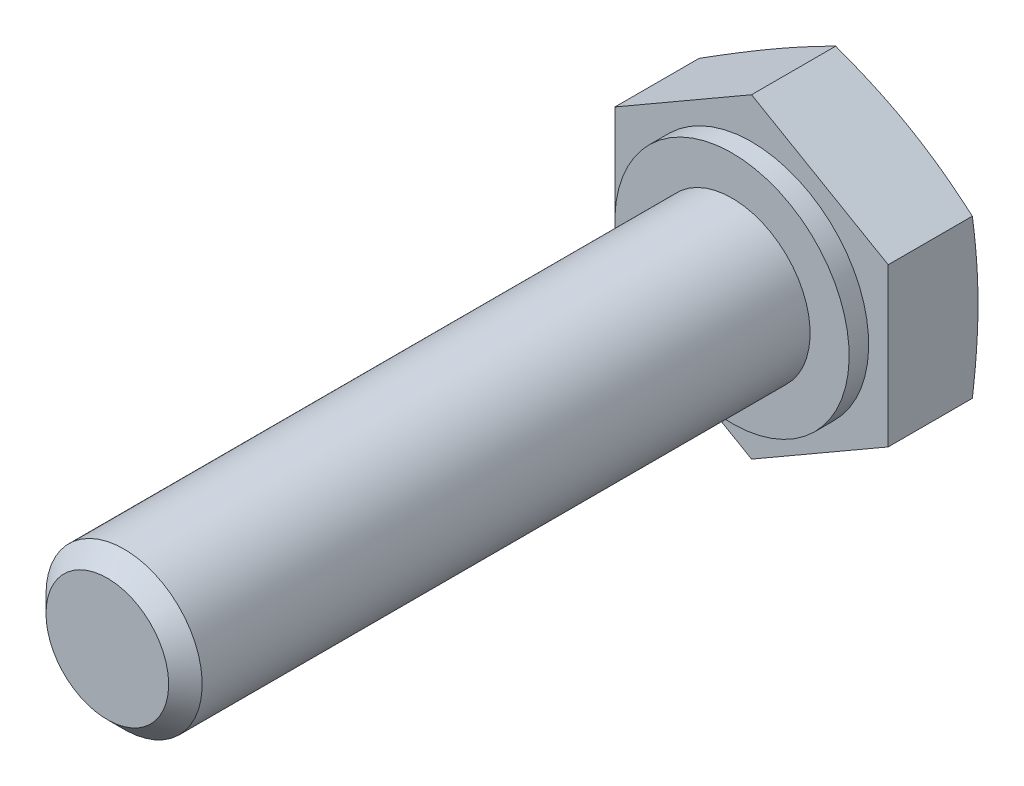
ISO-10303-21;
HEADER;
FILE_DESCRIPTION(('STEP AP214'),'2;1');
FILE_NAME('part.step','',(''),(''),'','','');
FILE_SCHEMA(('AUTOMOTIVE_DESIGN { 1 0 10303 214 1 1 1 1 }'));
ENDSEC;
DATA;
#1=APPLICATION_CONTEXT('core data for automotive mechanical design processes');
#2=APPLICATION_PROTOCOL_DEFINITION('international standard','automotive_design',2000,#1);
#3=PRODUCT_CONTEXT('',#1,'mechanical');
#4=PRODUCT('Part','Part','',(#3));
#5=PRODUCT_RELATED_PRODUCT_CATEGORY('part','',(#4));
#6=PRODUCT_DEFINITION_FORMATION('','',#4);
#7=PRODUCT_DEFINITION_CONTEXT('part definition',#1,'design');
#8=PRODUCT_DEFINITION('design','',#6,#7);
#9=PRODUCT_DEFINITION_SHAPE('','',#8);
#10=(LENGTH_UNIT() NAMED_UNIT(*) SI_UNIT(.MILLI.,.METRE.));
#11=(NAMED_UNIT(*) PLANE_ANGLE_UNIT() SI_UNIT($,.RADIAN.));
#12=(NAMED_UNIT(*) SI_UNIT($,.STERADIAN.) SOLID_ANGLE_UNIT());
#13=UNCERTAINTY_MEASURE_WITH_UNIT(LENGTH_MEASURE(1.E-05),#10,'distance_accuracy_value','');
#14=(GEOMETRIC_REPRESENTATION_CONTEXT(3) GLOBAL_UNCERTAINTY_ASSIGNED_CONTEXT((#13)) GLOBAL_UNIT_ASSIGNED_CONTEXT((#10,
#11,#12)) REPRESENTATION_CONTEXT('',''));
#15=CARTESIAN_POINT('',(0.,0.,0.));
#16=DIRECTION('',(0.,0.,1.));
#17=DIRECTION('',(1.,0.,0.));
#18=AXIS2_PLACEMENT_3D('',#15,#16,#17);
#19=CARTESIAN_POINT('',(6.49519052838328,-3.75,2.3));
#20=DIRECTION('',(0.,0.,1.));
#21=DIRECTION('',(-0.5,-0.866025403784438,0.));
#22=AXIS2_PLACEMENT_3D('',#19,#20,#21);
#23=PLANE('',#22);
#24=CARTESIAN_POINT('',(0.,0.,2.3));
#25=DIRECTION('',(0.,0.,-1.));
#26=DIRECTION('',(0.5,0.866025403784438,0.));
#27=AXIS2_PLACEMENT_3D('',#24,#25,#26);
#28=CIRCLE('',#27,3.);
#29=CARTESIAN_POINT('',(1.5,2.59807621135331,2.3));
#30=VERTEX_POINT('',#29);
#31=EDGE_CURVE('E159',#30,#30,#28,.T.);
#32=ORIENTED_EDGE('',*,*,#31,.T.);
#33=EDGE_LOOP('',(#32));
#34=FACE_BOUND('',#33,.T.);
#35=DIRECTION('',(-0.866025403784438,0.5,0.));
#36=VECTOR('',#35,1.);
#37=CARTESIAN_POINT('',(8.24519052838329,-0.718911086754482,2.3));
#38=LINE('',#37,#36);
#39=CARTESIAN_POINT('',(3.5,2.02072594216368,2.3));
#40=VERTEX_POINT('',#39);
#41=CARTESIAN_POINT('',(0.,4.04145188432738,2.3));
#42=VERTEX_POINT('',#41);
#43=EDGE_CURVE('E161',#40,#42,#38,.T.);
#44=ORIENTED_EDGE('',*,*,#43,.T.);
#45=DIRECTION('',(-0.866025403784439,-0.5,0.));
#46=VECTOR('',#45,1.);
#47=CARTESIAN_POINT('',(1.49759526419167,4.90608891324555,2.3));
#48=LINE('',#47,#46);
#49=CARTESIAN_POINT('',(-3.5,2.02072594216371,2.3));
#50=VERTEX_POINT('',#49);
#51=EDGE_CURVE('E9',#42,#50,#48,.T.);
#52=ORIENTED_EDGE('',*,*,#51,.T.);
#53=DIRECTION('',(0.,-1.,0.));
#54=VECTOR('',#53,1.);
#55=CARTESIAN_POINT('',(-3.5,-3.75,2.3));
#56=LINE('',#55,#54);
#57=CARTESIAN_POINT('',(-3.5,-2.02072594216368,2.3));
#58=VERTEX_POINT('',#57);
#59=EDGE_CURVE('E22',#50,#58,#56,.T.);
#60=ORIENTED_EDGE('',*,*,#59,.T.);
#61=DIRECTION('',(0.866025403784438,-0.5,0.));
#62=VECTOR('',#61,1.);
#63=CARTESIAN_POINT('',(4.74519052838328,-6.78108891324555,2.3));
#64=LINE('',#63,#62);
#65=CARTESIAN_POINT('',(0.,-4.04145188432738,2.3));
#66=VERTEX_POINT('',#65);
#67=EDGE_CURVE('E175',#58,#66,#64,.T.);
#68=ORIENTED_EDGE('',*,*,#67,.T.);
#69=DIRECTION('',(0.866025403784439,0.5,0.));
#70=VECTOR('',#69,1.);
#71=CARTESIAN_POINT('',(4.99759526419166,-1.15608891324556,2.3));
#72=LINE('',#71,#70);
#73=CARTESIAN_POINT('',(3.5,-2.02072594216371,2.3));
#74=VERTEX_POINT('',#73);
#75=EDGE_CURVE('E167',#66,#74,#72,.T.);
#76=ORIENTED_EDGE('',*,*,#75,.T.);
#77=DIRECTION('',(0.,1.,0.));
#78=VECTOR('',#77,1.);
#79=CARTESIAN_POINT('',(3.5,-3.75,2.3));
#80=LINE('',#79,#78);
#81=EDGE_CURVE('E164',#74,#40,#80,.T.);
#82=ORIENTED_EDGE('',*,*,#81,.T.);
#83=EDGE_LOOP('',(#44,#52,#60,#68,#76,#82));
#84=FACE_BOUND('',#83,.T.);
#85=ADVANCED_FACE('F14',(#34,#84),#23,.T.);
#86=CARTESIAN_POINT('',(0.,0.,18.8));
#87=DIRECTION('',(0.,0.,-1.));
#88=DIRECTION('',(0.5,0.866025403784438,0.));
#89=AXIS2_PLACEMENT_3D('',#86,#87,#88);
#90=CYLINDRICAL_SURFACE('',#89,3.);
#91=CARTESIAN_POINT('',(0.,0.,2.8));
#92=DIRECTION('',(0.,0.,-1.));
#93=DIRECTION('',(0.5,0.866025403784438,0.));
#94=AXIS2_PLACEMENT_3D('',#91,#92,#93);
#95=CIRCLE('',#94,3.);
#96=CARTESIAN_POINT('',(1.5,2.59807621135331,2.8));
#97=VERTEX_POINT('',#96);
#98=EDGE_CURVE('E251',#97,#97,#95,.T.);
#99=ORIENTED_EDGE('',*,*,#98,.T.);
#100=EDGE_LOOP('',(#99));
#101=FACE_BOUND('',#100,.T.);
#102=ORIENTED_EDGE('',*,*,#31,.F.);
#103=EDGE_LOOP('',(#102));
#104=FACE_BOUND('',#103,.T.);
#105=ADVANCED_FACE('F147',(#101,#104),#90,.T.);
#106=CARTESIAN_POINT('',(2.59807621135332,-1.5,2.8));
#107=DIRECTION('',(0.,0.,1.));
#108=DIRECTION('',(-0.5,-0.866025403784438,0.));
#109=AXIS2_PLACEMENT_3D('',#106,#107,#108);
#110=PLANE('',#109);
#111=CARTESIAN_POINT('',(0.,0.,2.8));
#112=DIRECTION('',(0.,0.,-1.));
#113=DIRECTION('',(0.5,0.866025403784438,0.));
#114=AXIS2_PLACEMENT_3D('',#111,#112,#113);
#115=CIRCLE('',#114,2.);
#116=CARTESIAN_POINT('',(1.,1.73205080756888,2.8));
#117=VERTEX_POINT('',#116);
#118=EDGE_CURVE('E253',#117,#117,#115,.T.);
#119=ORIENTED_EDGE('',*,*,#118,.T.);
#120=EDGE_LOOP('',(#119));
#121=FACE_BOUND('',#120,.T.);
#122=ORIENTED_EDGE('',*,*,#98,.F.);
#123=EDGE_LOOP('',(#122));
#124=FACE_BOUND('',#123,.T.);
#125=ADVANCED_FACE('F143',(#121,#124),#110,.T.);
#126=CARTESIAN_POINT('',(0.,0.,18.8));
#127=DIRECTION('',(0.,0.,-1.));
#128=DIRECTION('',(0.5,0.866025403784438,0.));
#129=AXIS2_PLACEMENT_3D('',#126,#127,#128);
#130=CYLINDRICAL_SURFACE('',#129,2.);
#131=CARTESIAN_POINT('',(0.,0.,18.3705));
#132=DIRECTION('',(0.,0.,-1.));
#133=DIRECTION('',(0.5,0.866025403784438,0.));
#134=AXIS2_PLACEMENT_3D('',#131,#132,#133);
#135=CIRCLE('',#134,2.);
#136=CARTESIAN_POINT('',(0.999999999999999,1.73205080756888,18.3705));
#137=VERTEX_POINT('',#136);
#138=EDGE_CURVE('E257',#137,#137,#135,.T.);
#139=ORIENTED_EDGE('',*,*,#138,.T.);
#140=EDGE_LOOP('',(#139));
#141=FACE_BOUND('',#140,.T.);
#142=ORIENTED_EDGE('',*,*,#118,.F.);
#143=EDGE_LOOP('',(#142));
#144=FACE_BOUND('',#143,.T.);
#145=ADVANCED_FACE('F139',(#141,#144),#130,.T.);
#146=CARTESIAN_POINT('',(0.,0.,18.3705));
#147=DIRECTION('',(0.,0.,-1.));
#148=DIRECTION('',(0.5,0.866025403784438,0.));
#149=AXIS2_PLACEMENT_3D('',#146,#147,#148);
#150=CONICAL_SURFACE('',#149,2.,0.785398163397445);
#151=CARTESIAN_POINT('',(0.,0.,18.8));
#152=DIRECTION('',(0.,0.,-1.));
#153=DIRECTION('',(0.5,0.866025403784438,0.));
#154=AXIS2_PLACEMENT_3D('',#151,#152,#153);
#155=CIRCLE('',#154,1.5705);
#156=CARTESIAN_POINT('',(0.785249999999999,1.36009289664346,18.8));
#157=VERTEX_POINT('',#156);
#158=EDGE_CURVE('E105',#157,#157,#155,.T.);
#159=ORIENTED_EDGE('',*,*,#158,.T.);
#160=EDGE_LOOP('',(#159));
#161=FACE_BOUND('',#160,.T.);
#162=ORIENTED_EDGE('',*,*,#138,.F.);
#163=EDGE_LOOP('',(#162));
#164=FACE_BOUND('',#163,.T.);
#165=ADVANCED_FACE('F135',(#161,#164),#150,.T.);
#166=CARTESIAN_POINT('',(1.36009289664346,-0.78525,18.8));
#167=DIRECTION('',(0.,0.,1.));
#168=DIRECTION('',(-0.5,-0.866025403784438,0.));
#169=AXIS2_PLACEMENT_3D('',#166,#167,#168);
#170=PLANE('',#169);
#171=ORIENTED_EDGE('',*,*,#158,.F.);
#172=EDGE_LOOP('',(#171));
#173=FACE_BOUND('',#172,.T.);
#174=ADVANCED_FACE('F130',(#173),#170,.T.);
#175=CARTESIAN_POINT('',(0.,4.04145188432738,0.));
#176=DIRECTION('',(-0.5,0.866025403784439,0.));
#177=DIRECTION('',(-0.866025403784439,-0.5,0.));
#178=AXIS2_PLACEMENT_3D('',#175,#176,#177);
#179=PLANE('',#178);
#180=DIRECTION('',(0.,0.,1.));
#181=VECTOR('',#180,1.);
#182=CARTESIAN_POINT('',(-3.5,2.02072594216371,0.));
#183=LINE('',#182,#181);
#184=CARTESIAN_POINT('',(-3.5,2.02072594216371,0.145081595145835));
#185=VERTEX_POINT('',#184);
#186=EDGE_CURVE('E180',#185,#50,#183,.T.);
#187=ORIENTED_EDGE('',*,*,#186,.T.);
#188=ORIENTED_EDGE('',*,*,#51,.F.);
#189=DIRECTION('',(0.,0.,1.));
#190=VECTOR('',#189,1.);
#191=CARTESIAN_POINT('',(0.,4.04145188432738,0.));
#192=LINE('',#191,#190);
#193=CARTESIAN_POINT('',(0.,4.04145188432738,0.145081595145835));
#194=VERTEX_POINT('',#193);
#195=EDGE_CURVE('E35',#194,#42,#192,.T.);
#196=ORIENTED_EDGE('',*,*,#195,.F.);
#197=CARTESIAN_POINT('',(-3.5002,2.02061047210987,0.14511253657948));
#198=CARTESIAN_POINT('',(-3.35483723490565,2.10453570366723,0.12261440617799));
#199=CARTESIAN_POINT('',(-3.20921089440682,2.18861311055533,0.102189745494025));
#200=CARTESIAN_POINT('',(-2.91744387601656,2.3570648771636,0.0663054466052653));
#201=CARTESIAN_POINT('',(-2.77130301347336,2.44143934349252,0.0508478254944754));
#202=CARTESIAN_POINT('',(-2.47939308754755,2.60997361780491,0.0258000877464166));
#203=CARTESIAN_POINT('',(-2.33362599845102,2.69413228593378,0.0161800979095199));
#204=CARTESIAN_POINT('',(-2.04190591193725,2.86255695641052,0.0032806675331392));
#205=CARTESIAN_POINT('',(-1.89595295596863,2.94682293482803,0.));
#206=CARTESIAN_POINT('',(-1.60404704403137,3.11535489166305,0.));
#207=CARTESIAN_POINT('',(-1.45809408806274,3.19962087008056,0.00328066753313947));
#208=CARTESIAN_POINT('',(-1.16637400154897,3.3680455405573,0.0161800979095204));
#209=CARTESIAN_POINT('',(-1.02060691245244,3.45220420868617,0.0258000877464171));
#210=CARTESIAN_POINT('',(-0.728696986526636,3.62073848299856,0.0508478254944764));
#211=CARTESIAN_POINT('',(-0.582556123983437,3.70511294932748,0.0663054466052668));
#212=CARTESIAN_POINT('',(-0.290789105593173,3.87356471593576,0.102189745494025));
#213=CARTESIAN_POINT('',(-0.145162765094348,3.95764212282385,0.122614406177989));
#214=CARTESIAN_POINT('',(0.000199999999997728,4.04156735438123,0.145112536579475));
#215=B_SPLINE_CURVE_WITH_KNOTS('',3,(#197,#198,#199,#200,#201,#202,#203,#204,#205,#206,#207,
#208,#209,#210,#211,#212,#213,#214),.UNSPECIFIED.,.F.,.F.,(4,2,2,2,2,2,2,2,4),(0.,
0.508081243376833,1.01636855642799,1.52203235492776,2.02759827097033,2.53316418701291,
3.03882798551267,3.54711529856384,4.05519654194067),.UNSPECIFIED.);
#216=CARTESIAN_POINT('',(-1.75,3.03108891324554,0.));
#217=VERTEX_POINT('',#216);
#218=EDGE_CURVE('E95',#217,#194,#215,.T.);
#219=ORIENTED_EDGE('',*,*,#218,.F.);
#220=EDGE_CURVE('E102',#185,#217,#215,.T.);
#221=ORIENTED_EDGE('',*,*,#220,.F.);
#222=EDGE_LOOP('',(#187,#188,#196,#219,#221));
#223=FACE_BOUND('',#222,.T.);
#224=ADVANCED_FACE('F94',(#223),#179,.T.);
#225=CARTESIAN_POINT('',(-3.5,2.02072594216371,0.));
#226=DIRECTION('',(-1.,0.,0.));
#227=DIRECTION('',(0.,-1.,0.));
#228=AXIS2_PLACEMENT_3D('',#225,#226,#227);
#229=PLANE('',#228);
#230=DIRECTION('',(0.,0.,1.));
#231=VECTOR('',#230,1.);
#232=CARTESIAN_POINT('',(-3.5,-2.02072594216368,0.));
#233=LINE('',#232,#231);
#234=CARTESIAN_POINT('',(-3.5,-2.02072594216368,0.145081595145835));
#235=VERTEX_POINT('',#234);
#236=EDGE_CURVE('E183',#235,#58,#233,.T.);
#237=ORIENTED_EDGE('',*,*,#236,.T.);
#238=ORIENTED_EDGE('',*,*,#59,.F.);
#239=ORIENTED_EDGE('',*,*,#186,.F.);
#240=CARTESIAN_POINT('',(-3.5,-2.02095688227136,0.145112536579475));
#241=CARTESIAN_POINT('',(-3.5,-1.85310641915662,0.122614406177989));
#242=CARTESIAN_POINT('',(-3.50000000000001,-1.68495160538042,0.102189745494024));
#243=CARTESIAN_POINT('',(-3.50000000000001,-1.34804807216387,0.0663054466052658));
#244=CARTESIAN_POINT('',(-3.50000000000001,-1.17929913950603,0.0508478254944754));
#245=CARTESIAN_POINT('',(-3.5,-0.842230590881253,0.0258000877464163));
#246=CARTESIAN_POINT('',(-3.5,-0.673913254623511,0.0161800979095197));
#247=CARTESIAN_POINT('',(-3.5,-0.337063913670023,0.00328066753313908));
#248=CARTESIAN_POINT('',(-3.5,-0.168531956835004,0.));
#249=CARTESIAN_POINT('',(-3.5,0.168531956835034,0.));
#250=CARTESIAN_POINT('',(-3.5,0.337063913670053,0.00328066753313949));
#251=CARTESIAN_POINT('',(-3.5,0.673913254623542,0.0161800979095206));
#252=CARTESIAN_POINT('',(-3.5,0.842230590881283,0.0258000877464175));
#253=CARTESIAN_POINT('',(-3.5,1.17929913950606,0.0508478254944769));
#254=CARTESIAN_POINT('',(-3.5,1.3480480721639,0.0663054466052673));
#255=CARTESIAN_POINT('',(-3.5,1.68495160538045,0.102189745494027));
#256=CARTESIAN_POINT('',(-3.5,1.85310641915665,0.122614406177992));
#257=CARTESIAN_POINT('',(-3.5,2.02095688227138,0.14511253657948));
#258=B_SPLINE_CURVE_WITH_KNOTS('',3,(#240,#241,#242,#243,#244,#245,#246,#247,#248,#249,#250,
#251,#252,#253,#254,#255,#256,#257),.UNSPECIFIED.,.F.,.F.,(4,2,2,2,2,2,2,2,4),(0.,
0.508081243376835,1.016368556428,1.52203235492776,2.02759827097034,2.53316418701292,
3.03882798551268,3.54711529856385,4.05519654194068),.UNSPECIFIED.);
#259=CARTESIAN_POINT('',(-3.5,0.,0.));
#260=VERTEX_POINT('',#259);
#261=EDGE_CURVE('E107',#260,#185,#258,.T.);
#262=ORIENTED_EDGE('',*,*,#261,.F.);
#263=EDGE_CURVE('E103',#235,#260,#258,.T.);
#264=ORIENTED_EDGE('',*,*,#263,.F.);
#265=EDGE_LOOP('',(#237,#238,#239,#262,#264));
#266=FACE_BOUND('',#265,.T.);
#267=ADVANCED_FACE('F129',(#266),#229,.T.);
#268=CARTESIAN_POINT('',(-3.5,-2.02072594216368,0.));
#269=DIRECTION('',(-0.5,-0.866025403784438,0.));
#270=DIRECTION('',(0.866025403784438,-0.5,0.));
#271=AXIS2_PLACEMENT_3D('',#268,#269,#270);
#272=PLANE('',#271);
#273=DIRECTION('',(0.,0.,1.));
#274=VECTOR('',#273,1.);
#275=CARTESIAN_POINT('',(0.,-4.04145188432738,0.));
#276=LINE('',#275,#274);
#277=CARTESIAN_POINT('',(0.,-4.04145188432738,0.145081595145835));
#278=VERTEX_POINT('',#277);
#279=EDGE_CURVE('E185',#278,#66,#276,.T.);
#280=ORIENTED_EDGE('',*,*,#279,.T.);
#281=ORIENTED_EDGE('',*,*,#67,.F.);
#282=ORIENTED_EDGE('',*,*,#236,.F.);
#283=CARTESIAN_POINT('',(-6.43477898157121,-0.326330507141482,0.788587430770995));
#284=CARTESIAN_POINT('',(-6.2966105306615,-0.406102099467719,0.752704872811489));
#285=CARTESIAN_POINT('',(-6.15835717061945,-0.485922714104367,0.717250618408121));
#286=CARTESIAN_POINT('',(-5.88163880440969,-0.645686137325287,0.647430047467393));
#287=CARTESIAN_POINT('',(-5.74317378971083,-0.725628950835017,0.61306377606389));
#288=CARTESIAN_POINT('',(-5.46587479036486,-0.885727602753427,0.545622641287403));
#289=CARTESIAN_POINT('',(-5.32704058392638,-0.965883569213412,0.512548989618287));
#290=CARTESIAN_POINT('',(-5.04908716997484,-1.12636004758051,0.448039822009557));
#291=CARTESIAN_POINT('',(-4.90996796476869,-1.20668055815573,0.416604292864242));
#292=CARTESIAN_POINT('',(-4.63252957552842,-1.36685968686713,0.356010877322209));
#293=CARTESIAN_POINT('',(-4.49421310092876,-1.44671674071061,0.326836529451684));
#294=CARTESIAN_POINT('',(-4.21720602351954,-1.60664685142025,0.270965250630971));
#295=CARTESIAN_POINT('',(-4.07851542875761,-1.68671990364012,0.244268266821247));
#296=CARTESIAN_POINT('',(-3.80072692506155,-1.84710117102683,0.193939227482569));
#297=CARTESIAN_POINT('',(-3.66162905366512,-1.92740936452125,0.170306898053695));
#298=CARTESIAN_POINT('',(-3.38298715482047,-2.08828333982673,0.126791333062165));
#299=CARTESIAN_POINT('',(-3.2434431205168,-2.16884912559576,0.106908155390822));
#300=CARTESIAN_POINT('',(-2.96230621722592,-2.33116359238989,0.0714390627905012));
#301=CARTESIAN_POINT('',(-2.82070831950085,-2.41291517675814,0.0559055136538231));
#302=CARTESIAN_POINT('',(-2.5371537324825,-2.57662549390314,0.0302006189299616));
#303=CARTESIAN_POINT('',(-2.39519707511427,-2.65858420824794,0.0200288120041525));
#304=CARTESIAN_POINT('',(-2.11112029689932,-2.82259601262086,0.00563798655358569));
#305=CARTESIAN_POINT('',(-1.96900028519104,-2.90464903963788,0.00141615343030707));
#306=CARTESIAN_POINT('',(-1.68472330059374,-3.06877643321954,-0.000813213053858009));
#307=CARTESIAN_POINT('',(-1.5425663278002,-3.15085079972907,0.00117923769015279));
#308=CARTESIAN_POINT('',(-1.25786761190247,-3.31522167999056,0.011268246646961));
#309=CARTESIAN_POINT('',(-1.11532650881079,-3.39751782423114,0.0193883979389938));
#310=CARTESIAN_POINT('',(-0.830567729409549,-3.56192338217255,0.0412654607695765));
#311=CARTESIAN_POINT('',(-0.688350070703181,-3.64403278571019,0.0550226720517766));
#312=CARTESIAN_POINT('',(-0.404245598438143,-3.80806057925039,0.0874629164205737));
#313=CARTESIAN_POINT('',(-0.2623590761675,-3.88997880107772,0.106149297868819));
#314=CARTESIAN_POINT('',(0.0209548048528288,-4.05355014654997,0.147651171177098));
#315=CARTESIAN_POINT('',(0.162382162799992,-4.13520326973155,0.170466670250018));
#316=CARTESIAN_POINT('',(0.446697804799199,-4.29935298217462,0.219806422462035));
#317=CARTESIAN_POINT('',(0.589580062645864,-4.3818460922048,0.246376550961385));
#318=CARTESIAN_POINT('',(0.874933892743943,-4.54659520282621,0.302317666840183));
#319=CARTESIAN_POINT('',(1.01740545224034,-4.62885119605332,0.33168874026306));
#320=CARTESIAN_POINT('',(1.44431490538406,-4.87532748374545,0.423145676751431));
#321=CARTESIAN_POINT('',(1.72821480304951,-5.03923716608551,0.488569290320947));
#322=CARTESIAN_POINT('',(2.29504978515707,-5.3664994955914,0.625143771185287));
#323=CARTESIAN_POINT('',(2.5779845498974,-5.52985195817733,0.69629637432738));
#324=CARTESIAN_POINT('',(3.14312078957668,-5.85613351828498,0.84240612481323));
#325=CARTESIAN_POINT('',(3.42532224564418,-6.01906260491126,0.917363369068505));
#326=CARTESIAN_POINT('',(3.98606865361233,-6.34280969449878,1.0690372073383));
#327=CARTESIAN_POINT('',(4.26461946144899,-6.50363107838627,1.14572508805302));
#328=CARTESIAN_POINT('',(4.82134778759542,-6.82505832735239,1.30091567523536));
#329=CARTESIAN_POINT('',(5.09952529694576,-6.98566418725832,1.37941842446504));
#330=CARTESIAN_POINT('',(5.65518946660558,-7.30647704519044,1.53762775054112));
#331=CARTESIAN_POINT('',(5.9326765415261,-7.46668428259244,1.61733239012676));
#332=CARTESIAN_POINT('',(6.48742193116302,-7.78696668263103,1.77774607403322));
#333=CARTESIAN_POINT('',(6.76468025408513,-7.94704185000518,1.8584550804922));
#334=CARTESIAN_POINT('',(7.04186109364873,-8.10707228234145,1.93951337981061));
#335=B_SPLINE_CURVE_WITH_KNOTS('',3,(#283,#284,#285,#286,#287,#288,#289,#290,#291,#292,#293,
#294,#295,#296,#297,#298,#299,#300,#301,#302,#303,#304,#305,#306,#307,#308,#309,#310,#311,#312,
#313,#314,#315,#316,#317,#318,#319,#320,#321,#322,#323,#324,#325,#326,#327,#328,#329,#330,#331,
#332,#333,#334),.UNSPECIFIED.,.F.,.F.,(4,2,2,2,2,2,2,2,2,2,2,2,2,2,2,2,2,2,2,2,2,2,2,2,2,4),(0.,
0.490587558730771,0.981195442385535,1.47225270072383,1.96330599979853,2.45036091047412,
2.93740542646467,3.42440638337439,3.91141485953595,4.4040564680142,4.89665568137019,
5.38902179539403,5.88138665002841,6.3756569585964,6.86995355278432,7.36458678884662,
7.85922088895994,8.36052700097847,8.86184851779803,9.86460642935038,10.8676693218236,
11.87075777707,12.8627268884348,13.8547193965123,14.8452550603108,15.8357534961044),.UNSPECIFIED.);
#336=CARTESIAN_POINT('',(-1.75,-3.03108891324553,0.));
#337=VERTEX_POINT('',#336);
#338=EDGE_CURVE('E221',#337,#235,#335,.F.);
#339=ORIENTED_EDGE('',*,*,#338,.F.);
#340=EDGE_CURVE('E227',#278,#337,#335,.F.);
#341=ORIENTED_EDGE('',*,*,#340,.F.);
#342=EDGE_LOOP('',(#280,#281,#282,#339,#341));
#343=FACE_BOUND('',#342,.T.);
#344=ADVANCED_FACE('F215',(#343),#272,.T.);
#345=CARTESIAN_POINT('',(0.,-4.04145188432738,0.));
#346=DIRECTION('',(0.5,-0.866025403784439,0.));
#347=DIRECTION('',(0.866025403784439,0.5,0.));
#348=AXIS2_PLACEMENT_3D('',#345,#346,#347);
#349=PLANE('',#348);
#350=DIRECTION('',(0.,0.,1.));
#351=VECTOR('',#350,1.);
#352=CARTESIAN_POINT('',(3.5,-2.02072594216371,0.));
#353=LINE('',#352,#351);
#354=CARTESIAN_POINT('',(3.5,-2.02072594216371,0.145081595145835));
#355=VERTEX_POINT('',#354);
#356=EDGE_CURVE('E596',#355,#74,#353,.T.);
#357=ORIENTED_EDGE('',*,*,#356,.T.);
#358=ORIENTED_EDGE('',*,*,#75,.F.);
#359=ORIENTED_EDGE('',*,*,#279,.F.);
#360=CARTESIAN_POINT('',(3.5002,-2.02061047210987,0.14511253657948));
#361=CARTESIAN_POINT('',(3.35483723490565,-2.10453570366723,0.122614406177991));
#362=CARTESIAN_POINT('',(3.20921089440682,-2.18861311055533,0.102189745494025));
#363=CARTESIAN_POINT('',(2.91744387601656,-2.3570648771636,0.0663054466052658));
#364=CARTESIAN_POINT('',(2.77130301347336,-2.44143934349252,0.0508478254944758));
#365=CARTESIAN_POINT('',(2.47939308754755,-2.60997361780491,0.0258000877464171));
#366=CARTESIAN_POINT('',(2.33362599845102,-2.69413228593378,0.0161800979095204));
#367=CARTESIAN_POINT('',(2.04190591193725,-2.86255695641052,0.00328066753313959));
#368=CARTESIAN_POINT('',(1.89595295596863,-2.94682293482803,0.));
#369=CARTESIAN_POINT('',(1.60404704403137,-3.11535489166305,0.));
#370=CARTESIAN_POINT('',(1.45809408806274,-3.19962087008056,0.00328066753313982));
#371=CARTESIAN_POINT('',(1.16637400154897,-3.3680455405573,0.0161800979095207));
#372=CARTESIAN_POINT('',(1.02060691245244,-3.45220420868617,0.0258000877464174));
#373=CARTESIAN_POINT('',(0.728696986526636,-3.62073848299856,0.0508478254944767));
#374=CARTESIAN_POINT('',(0.582556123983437,-3.70511294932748,0.0663054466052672));
#375=CARTESIAN_POINT('',(0.290789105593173,-3.87356471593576,0.102189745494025));
#376=CARTESIAN_POINT('',(0.145162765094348,-3.95764212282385,0.122614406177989));
#377=CARTESIAN_POINT('',(-0.000199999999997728,-4.04156735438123,0.145112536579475));
#378=B_SPLINE_CURVE_WITH_KNOTS('',3,(#360,#361,#362,#363,#364,#365,#366,#367,#368,#369,#370,
#371,#372,#373,#374,#375,#376,#377),.UNSPECIFIED.,.F.,.F.,(4,2,2,2,2,2,2,2,4),(0.,
0.508081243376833,1.01636855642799,1.52203235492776,2.02759827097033,2.53316418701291,
3.03882798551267,3.54711529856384,4.05519654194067),.UNSPECIFIED.);
#379=CARTESIAN_POINT('',(1.75,-3.03108891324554,0.));
#380=VERTEX_POINT('',#379);
#381=EDGE_CURVE('E201',#380,#278,#378,.T.);
#382=ORIENTED_EDGE('',*,*,#381,.F.);
#383=EDGE_CURVE('E228',#355,#380,#378,.T.);
#384=ORIENTED_EDGE('',*,*,#383,.F.);
#385=EDGE_LOOP('',(#357,#358,#359,#382,#384));
#386=FACE_BOUND('',#385,.T.);
#387=ADVANCED_FACE('F210',(#386),#349,.T.);
#388=CARTESIAN_POINT('',(3.5,-2.02072594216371,0.));
#389=DIRECTION('',(1.,0.,0.));
#390=DIRECTION('',(0.,1.,0.));
#391=AXIS2_PLACEMENT_3D('',#388,#389,#390);
#392=PLANE('',#391);
#393=DIRECTION('',(0.,0.,1.));
#394=VECTOR('',#393,1.);
#395=CARTESIAN_POINT('',(3.5,2.02072594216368,0.));
#396=LINE('',#395,#394);
#397=CARTESIAN_POINT('',(3.5,2.02072594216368,0.145081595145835));
#398=VERTEX_POINT('',#397);
#399=EDGE_CURVE('E29',#398,#40,#396,.T.);
#400=ORIENTED_EDGE('',*,*,#399,.T.);
#401=ORIENTED_EDGE('',*,*,#81,.F.);
#402=ORIENTED_EDGE('',*,*,#356,.F.);
#403=CARTESIAN_POINT('',(3.5,2.02095688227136,0.145112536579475));
#404=CARTESIAN_POINT('',(3.5,1.85310641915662,0.122614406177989));
#405=CARTESIAN_POINT('',(3.50000000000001,1.68495160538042,0.102189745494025));
#406=CARTESIAN_POINT('',(3.50000000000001,1.34804807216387,0.0663054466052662));
#407=CARTESIAN_POINT('',(3.50000000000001,1.17929913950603,0.0508478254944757));
#408=CARTESIAN_POINT('',(3.5,0.842230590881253,0.0258000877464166));
#409=CARTESIAN_POINT('',(3.5,0.673913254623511,0.01618009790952));
#410=CARTESIAN_POINT('',(3.5,0.337063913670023,0.00328066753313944));
#411=CARTESIAN_POINT('',(3.5,0.168531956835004,0.));
#412=CARTESIAN_POINT('',(3.5,-0.168531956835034,0.));
#413=CARTESIAN_POINT('',(3.5,-0.337063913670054,0.00328066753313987));
#414=CARTESIAN_POINT('',(3.5,-0.673913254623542,0.016180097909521));
#415=CARTESIAN_POINT('',(3.5,-0.842230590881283,0.0258000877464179));
#416=CARTESIAN_POINT('',(3.5,-1.17929913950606,0.0508478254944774));
#417=CARTESIAN_POINT('',(3.5,-1.3480480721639,0.0663054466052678));
#418=CARTESIAN_POINT('',(3.5,-1.68495160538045,0.102189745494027));
#419=CARTESIAN_POINT('',(3.5,-1.85310641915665,0.122614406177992));
#420=CARTESIAN_POINT('',(3.5,-2.02095688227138,0.14511253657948));
#421=B_SPLINE_CURVE_WITH_KNOTS('',3,(#403,#404,#405,#406,#407,#408,#409,#410,#411,#412,#413,
#414,#415,#416,#417,#418,#419,#420),.UNSPECIFIED.,.F.,.F.,(4,2,2,2,2,2,2,2,4),(0.,
0.508081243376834,1.016368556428,1.52203235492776,2.02759827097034,2.53316418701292,
3.03882798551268,3.54711529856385,4.05519654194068),.UNSPECIFIED.);
#422=CARTESIAN_POINT('',(3.5,0.,0.));
#423=VERTEX_POINT('',#422);
#424=EDGE_CURVE('E90',#423,#355,#421,.T.);
#425=ORIENTED_EDGE('',*,*,#424,.F.);
#426=EDGE_CURVE('E200',#398,#423,#421,.T.);
#427=ORIENTED_EDGE('',*,*,#426,.F.);
#428=EDGE_LOOP('',(#400,#401,#402,#425,#427));
#429=FACE_BOUND('',#428,.T.);
#430=ADVANCED_FACE('F207',(#429),#392,.T.);
#431=CARTESIAN_POINT('',(3.5,2.02072594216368,0.));
#432=DIRECTION('',(0.5,0.866025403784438,0.));
#433=DIRECTION('',(-0.866025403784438,0.5,0.));
#434=AXIS2_PLACEMENT_3D('',#431,#432,#433);
#435=PLANE('',#434);
#436=ORIENTED_EDGE('',*,*,#195,.T.);
#437=ORIENTED_EDGE('',*,*,#43,.F.);
#438=ORIENTED_EDGE('',*,*,#399,.F.);
#439=CARTESIAN_POINT('',(-2.9347789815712,5.73584731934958,0.788587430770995));
#440=CARTESIAN_POINT('',(-2.79661053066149,5.65607572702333,0.752704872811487));
#441=CARTESIAN_POINT('',(-2.65835717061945,5.57625511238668,0.717250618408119));
#442=CARTESIAN_POINT('',(-2.38163880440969,5.41649168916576,0.647430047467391));
#443=CARTESIAN_POINT('',(-2.24317378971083,5.33654887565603,0.613063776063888));
#444=CARTESIAN_POINT('',(-1.96587479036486,5.17645022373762,0.545622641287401));
#445=CARTESIAN_POINT('',(-1.82704058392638,5.09629425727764,0.512548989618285));
#446=CARTESIAN_POINT('',(-1.54908716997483,4.93581777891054,0.448039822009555));
#447=CARTESIAN_POINT('',(-1.40996796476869,4.85549726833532,0.41660429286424));
#448=CARTESIAN_POINT('',(-1.13252957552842,4.69531813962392,0.356010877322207));
#449=CARTESIAN_POINT('',(-0.994213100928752,4.61546108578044,0.326836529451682));
#450=CARTESIAN_POINT('',(-0.717206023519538,4.4555309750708,0.270965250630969));
#451=CARTESIAN_POINT('',(-0.578515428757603,4.37545792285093,0.244268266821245));
#452=CARTESIAN_POINT('',(-0.300726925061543,4.21507665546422,0.193939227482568));
#453=CARTESIAN_POINT('',(-0.16162905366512,4.13476846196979,0.170306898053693));
#454=CARTESIAN_POINT('',(0.117012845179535,3.97389448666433,0.126791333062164));
#455=CARTESIAN_POINT('',(0.256556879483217,3.8933287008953,0.106908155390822));
#456=CARTESIAN_POINT('',(0.537693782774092,3.73101423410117,0.0714390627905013));
#457=CARTESIAN_POINT('',(0.679291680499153,3.64926264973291,0.0559055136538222));
#458=CARTESIAN_POINT('',(0.962846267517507,3.48555233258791,0.0302006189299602));
#459=CARTESIAN_POINT('',(1.10480292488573,3.40359361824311,0.0200288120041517));
#460=CARTESIAN_POINT('',(1.38887970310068,3.23958181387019,0.00563798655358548));
#461=CARTESIAN_POINT('',(1.53099971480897,3.15752878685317,0.00141615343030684));
#462=CARTESIAN_POINT('',(1.81527669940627,2.99340139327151,-0.000813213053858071));
#463=CARTESIAN_POINT('',(1.95743367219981,2.91132702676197,0.00117923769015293));
#464=CARTESIAN_POINT('',(2.24213238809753,2.74695614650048,0.0112682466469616));
#465=CARTESIAN_POINT('',(2.38467349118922,2.66466000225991,0.0193883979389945));
#466=CARTESIAN_POINT('',(2.66943227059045,2.5002544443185,0.0412654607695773));
#467=CARTESIAN_POINT('',(2.81164992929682,2.41814504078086,0.0550226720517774));
#468=CARTESIAN_POINT('',(3.09575440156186,2.25411724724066,0.087462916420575));
#469=CARTESIAN_POINT('',(3.2376409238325,2.17219902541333,0.106149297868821));
#470=CARTESIAN_POINT('',(3.52095480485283,2.00862767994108,0.147651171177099));
#471=CARTESIAN_POINT('',(3.6623821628,1.92697455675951,0.170466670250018));
#472=CARTESIAN_POINT('',(3.94669780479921,1.76282484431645,0.219806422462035));
#473=CARTESIAN_POINT('',(4.08958006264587,1.68033173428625,0.246376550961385));
#474=CARTESIAN_POINT('',(4.37493389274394,1.51558262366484,0.302317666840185));
#475=CARTESIAN_POINT('',(4.51740545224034,1.43332663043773,0.331688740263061));
#476=CARTESIAN_POINT('',(4.94431490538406,1.1868503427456,0.423145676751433));
#477=CARTESIAN_POINT('',(5.22821480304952,1.02294066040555,0.488569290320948));
#478=CARTESIAN_POINT('',(5.79504978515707,0.69567833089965,0.625143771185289));
#479=CARTESIAN_POINT('',(6.0779845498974,0.532325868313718,0.696296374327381));
#480=CARTESIAN_POINT('',(6.64312078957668,0.206044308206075,0.842406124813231));
#481=CARTESIAN_POINT('',(6.92532224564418,0.0431152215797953,0.917363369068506));
#482=CARTESIAN_POINT('',(7.48606865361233,-0.280631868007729,1.0690372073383));
#483=CARTESIAN_POINT('',(7.76461946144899,-0.441453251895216,1.14572508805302));
#484=CARTESIAN_POINT('',(8.32134778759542,-0.762880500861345,1.30091567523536));
#485=CARTESIAN_POINT('',(8.59952529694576,-0.923486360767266,1.37941842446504));
#486=CARTESIAN_POINT('',(9.15518946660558,-1.24429921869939,1.53762775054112));
#487=CARTESIAN_POINT('',(9.4326765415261,-1.40450645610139,1.61733239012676));
#488=CARTESIAN_POINT('',(9.98742193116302,-1.72478885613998,1.77774607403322));
#489=CARTESIAN_POINT('',(10.2646802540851,-1.88486402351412,1.8584550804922));
#490=CARTESIAN_POINT('',(10.5418610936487,-2.04489445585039,1.93951337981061));
#491=B_SPLINE_CURVE_WITH_KNOTS('',3,(#439,#440,#441,#442,#443,#444,#445,#446,#447,#448,#449,
#450,#451,#452,#453,#454,#455,#456,#457,#458,#459,#460,#461,#462,#463,#464,#465,#466,#467,#468,
#469,#470,#471,#472,#473,#474,#475,#476,#477,#478,#479,#480,#481,#482,#483,#484,#485,#486,#487,
#488,#489,#490),.UNSPECIFIED.,.F.,.F.,(4,2,2,2,2,2,2,2,2,2,2,2,2,2,2,2,2,2,2,2,2,2,2,2,2,4),(0.,
0.490587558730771,0.981195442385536,1.47225270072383,1.96330599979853,2.45036091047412,
2.93740542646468,3.4244063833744,3.91141485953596,4.4040564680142,4.89665568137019,
5.38902179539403,5.88138665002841,6.3756569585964,6.86995355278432,7.36458678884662,
7.85922088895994,8.36052700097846,8.86184851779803,9.86460642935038,10.8676693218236,
11.87075777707,12.8627268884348,13.8547193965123,14.8452550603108,15.8357534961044),.UNSPECIFIED.);
#492=CARTESIAN_POINT('',(1.75,3.03108891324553,0.));
#493=VERTEX_POINT('',#492);
#494=EDGE_CURVE('E85',#493,#398,#491,.T.);
#495=ORIENTED_EDGE('',*,*,#494,.F.);
#496=EDGE_CURVE('E82',#194,#493,#491,.T.);
#497=ORIENTED_EDGE('',*,*,#496,.F.);
#498=EDGE_LOOP('',(#436,#437,#438,#495,#497));
#499=FACE_BOUND('',#498,.T.);
#500=ADVANCED_FACE('F83',(#499),#435,.T.);
#501=CARTESIAN_POINT('',(0.,0.,0.));
#502=DIRECTION('',(0.,0.,1.));
#503=DIRECTION('',(-0.5,-0.866025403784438,0.));
#504=AXIS2_PLACEMENT_3D('',#501,#502,#503);
#505=CONICAL_SURFACE('',#504,3.5,1.30899693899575);
#506=CARTESIAN_POINT('',(0.,0.,0.));
#507=DIRECTION('',(0.,0.,-1.));
#508=DIRECTION('',(0.5,0.866025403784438,0.));
#509=AXIS2_PLACEMENT_3D('',#506,#507,#508);
#510=CIRCLE('',#509,3.5);
#511=EDGE_CURVE('E100',#217,#493,#510,.T.);
#512=ORIENTED_EDGE('',*,*,#511,.F.);
#513=ORIENTED_EDGE('',*,*,#218,.T.);
#514=ORIENTED_EDGE('',*,*,#496,.T.);
#515=EDGE_LOOP('',(#512,#513,#514));
#516=FACE_BOUND('',#515,.T.);
#517=ADVANCED_FACE('F99',(#516),#505,.T.);
#518=EDGE_CURVE('E249',#260,#217,#510,.T.);
#519=ORIENTED_EDGE('',*,*,#518,.F.);
#520=ORIENTED_EDGE('',*,*,#261,.T.);
#521=ORIENTED_EDGE('',*,*,#220,.T.);
#522=EDGE_LOOP('',(#519,#520,#521));
#523=FACE_BOUND('',#522,.T.);
#524=ADVANCED_FACE('F272',(#523),#505,.T.);
#525=EDGE_CURVE('E250',#337,#260,#510,.T.);
#526=ORIENTED_EDGE('',*,*,#525,.F.);
#527=ORIENTED_EDGE('',*,*,#338,.T.);
#528=ORIENTED_EDGE('',*,*,#263,.T.);
#529=EDGE_LOOP('',(#526,#527,#528));
#530=FACE_BOUND('',#529,.T.);
#531=ADVANCED_FACE('F270',(#530),#505,.T.);
#532=ORIENTED_EDGE('',*,*,#381,.T.);
#533=ORIENTED_EDGE('',*,*,#340,.T.);
#534=EDGE_CURVE('E246',#380,#337,#510,.T.);
#535=ORIENTED_EDGE('',*,*,#534,.F.);
#536=EDGE_LOOP('',(#532,#533,#535));
#537=FACE_BOUND('',#536,.T.);
#538=ADVANCED_FACE('F122',(#537),#505,.T.);
#539=ORIENTED_EDGE('',*,*,#424,.T.);
#540=ORIENTED_EDGE('',*,*,#383,.T.);
#541=EDGE_CURVE('E170',#423,#380,#510,.T.);
#542=ORIENTED_EDGE('',*,*,#541,.F.);
#543=EDGE_LOOP('',(#539,#540,#542));
#544=FACE_BOUND('',#543,.T.);
#545=ADVANCED_FACE('F243',(#544),#505,.T.);
#546=CARTESIAN_POINT('',(0.,0.,0.));
#547=DIRECTION('',(0.,0.,-1.));
#548=DIRECTION('',(0.5,0.866025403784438,0.));
#549=AXIS2_PLACEMENT_3D('',#546,#547,#548);
#550=PLANE('',#549);
#551=EDGE_CURVE('E165',#493,#423,#510,.T.);
#552=ORIENTED_EDGE('',*,*,#551,.T.);
#553=ORIENTED_EDGE('',*,*,#541,.T.);
#554=ORIENTED_EDGE('',*,*,#534,.T.);
#555=ORIENTED_EDGE('',*,*,#525,.T.);
#556=ORIENTED_EDGE('',*,*,#518,.T.);
#557=ORIENTED_EDGE('',*,*,#511,.T.);
#558=EDGE_LOOP('',(#552,#553,#554,#555,#556,#557));
#559=FACE_BOUND('',#558,.T.);
#560=ADVANCED_FACE('F16',(#559),#550,.T.);
#561=ORIENTED_EDGE('',*,*,#494,.T.);
#562=ORIENTED_EDGE('',*,*,#426,.T.);
#563=ORIENTED_EDGE('',*,*,#551,.F.);
#564=EDGE_LOOP('',(#561,#562,#563));
#565=FACE_BOUND('',#564,.T.);
#566=ADVANCED_FACE('F241',(#565),#505,.T.);
#567=CLOSED_SHELL('',(#85,#105,#125,#145,#165,#174,#224,#267,#344,#387,#430,#500,#517,#524,#531,
#538,#545,#560,#566));
#568=MANIFOLD_SOLID_BREP('B1',#567);
#569=ADVANCED_BREP_SHAPE_REPRESENTATION('',(#18,#568),#14);
#570=SHAPE_DEFINITION_REPRESENTATION(#9,#569);
ENDSEC;
END-ISO-10303-21;
